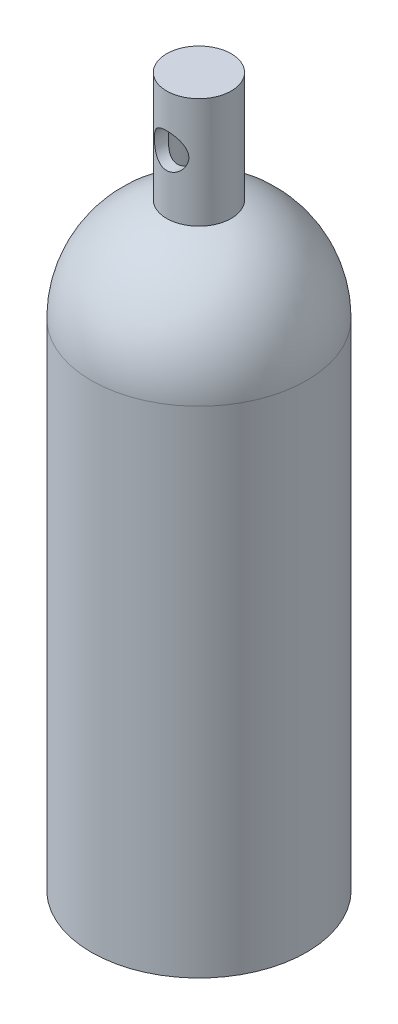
from build123d import *

# Parameters (mm, degrees)
SKETCH_TOOTHPASTE_TANK_R = 50
TOOTHPASTE_TANK_DEPTH    = 230
SHELL_TANK_SPACE_T       = -5
CUT_VALVE_REACH          = 242.624
CUT_VALVE_END_RADIUS     = 15
SKETCH_VALVE_R           = 8


with BuildPart() as part:
    # Sketch_Toothpaste Tank → Toothpaste Tank (new body)
    with BuildSketch(Plane(origin=(0, 0, 0), x_dir=(1, 0, 0), z_dir=(0, 1, 0))):
        with Locations(Location((0, 0, 0), (0, 0, 270))):
            Circle(SKETCH_TOOTHPASTE_TANK_R)
    extrude(amount=-TOOTHPASTE_TANK_DEPTH)

    # Shell_Tank Space
    shell_tank_space_openings = [part.faces().sort_by_distance(p)[0] for p in [
        (0, 0, 0),
    ]]
    offset(amount=SHELL_TANK_SPACE_T, openings=shell_tank_space_openings, kind=Kind.INTERSECTION)

    # Sketch_Tank Top → Revolve_Tank Top (revolve)
    with BuildSketch(Plane(origin=(0, 0, 0), x_dir=(0, 0, -1), z_dir=(1, 0, 0)), mode=Mode.PRIVATE) as revolve_tank_top_sk:
        with BuildLine():
            Line((-45, 0), (-50, 0))
            ThreePointArc((-50, 0), (-40.311288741, 29.580398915), (-15, 47.696960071))
            Line((-15, 47.696960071), (-15, 98.989794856))
            Line((-15, 98.989794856), (-10, 98.989794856))
            Line((-10, 98.989794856), (0, 98.989794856))
            Line((0, 98.989794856), (0, 93.874821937))
            Line((0, 93.874821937), (-10, 93.874821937))
            Line((-10, 93.874821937), (-10, 48.989794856))
            Line((-10, 48.989794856), (-10, 43.874821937))
            ThreePointArc((-10, 43.874821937), (-35.178118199, 28.062430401), (-45, 0))
        make_face()
    revolve(revolve_tank_top_sk.sketch.rotate(Axis((0, 48.989794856, 0), (0, 1, 0)), 180), axis=Axis((0, 48.989794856, 0), (0, 1, 0)))

    # Cut_Valve: up to this cylinder (the profile starts inside it)
    cut_valve_end = Plane(origin=(0, 75, 0), z_dir=(0, -1, 0)) * Cylinder(CUT_VALVE_END_RADIUS, 516.248, mode=Mode.PRIVATE)
    # Sketch_Valve → Cut_Valve (cut, up to the surface)
    with BuildSketch(Plane.XY, mode=Mode.PRIVATE) as cut_valve_sk1:
        with Locations(Location((0, 75, 0), (0, 0, 180))):
            Circle(SKETCH_VALVE_R)
    cut_valve_tool1 = extrude(cut_valve_sk1.sketch, amount=CUT_VALVE_REACH, mode=Mode.PRIVATE) & cut_valve_end
    add(cut_valve_tool1.solids().sort_by_distance((0, 75, 0))[0], mode=Mode.SUBTRACT)


solid = part.part
